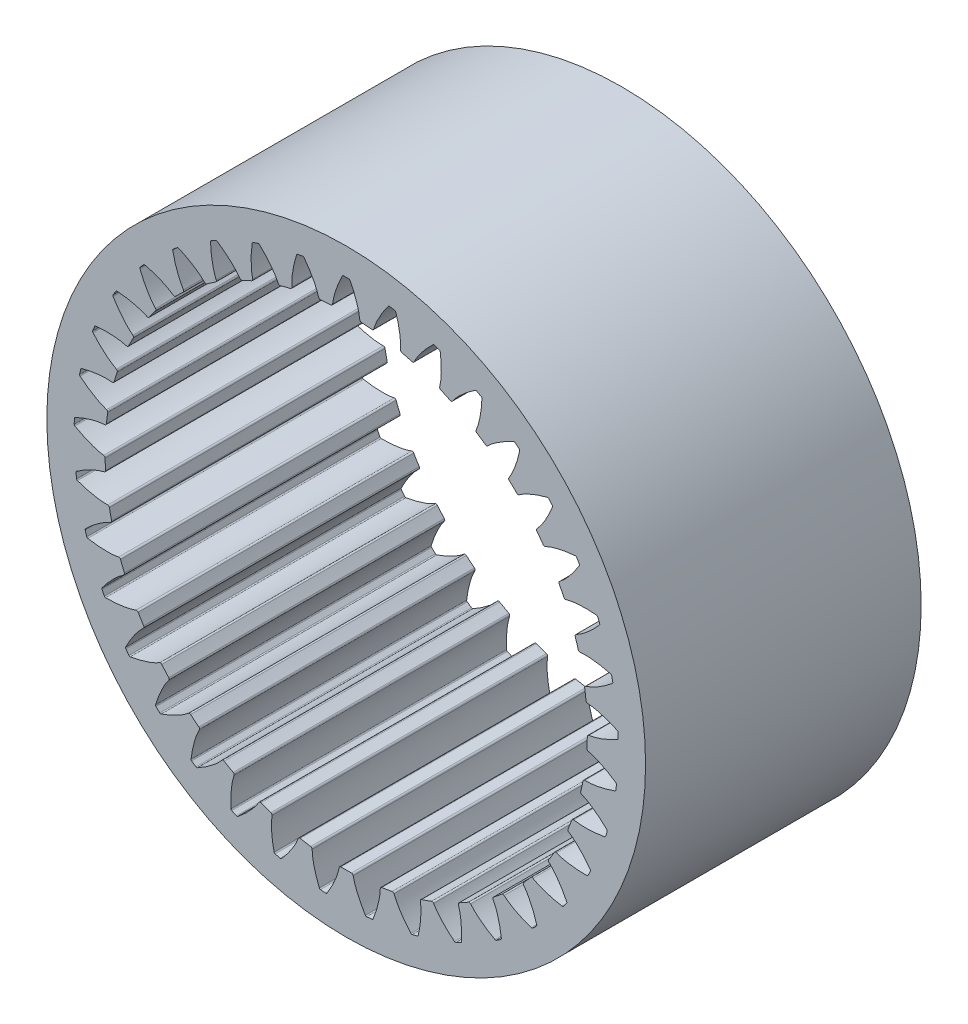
from build123d import *

# Parameters (mm, degrees)
SKETCH5_R              = 13.795375
SKETCH5_R_2            = 11.1125
RING_GEAR_BLANK_DEPTH  = 6.35
FIRST_TOOTH_DEPTH      = 21.516998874
TIP_RADIUS_R           = 0.079375
ROOT_FILLET_R          = 0.0635
TEETH_COUNT            = 37
TIP_RADIUS_OF_TEETH_R  = 0.079375
ROOT_FILLET_OF_TEETH_R = 0.0635


with BuildPart() as part:
    # Sketch5 → Ring Gear Blank (new, symmetric)
    with BuildSketch(Plane.XY):
        with Locations(Location((0, 0, 0), (0, 0, 180))):
            Circle(SKETCH5_R)
        with Locations(Location((0, 0, 0), (0, 0, 180))):
            Circle(SKETCH5_R_2, mode=Mode.SUBTRACT)
    extrude(amount=RING_GEAR_BLANK_DEPTH, both=True)

    # Sketch2 → First Tooth (cut, symmetric)
    with BuildSketch(Plane.XY):
        with BuildLine():
            ThreePointArc((0.159062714, 12.54024125), (0, 12.54125), (-0.159062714, 12.54024125))
            add(Edge.make_bspline(
                [(-0.159062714, 12.54024125), (-0.194460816, 12.472541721), (-0.24561014, 12.369969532), (-0.309503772, 12.23116819), (-0.355153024, 12.1260507), (-0.398397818, 12.019920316), (-0.439084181, 11.912781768), (-0.477032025, 11.804641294), (-0.512025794, 11.695506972), (-0.543802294, 11.585390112), (-0.572022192, 11.47430415), (-0.59625071, 11.362275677), (-0.615793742, 11.249316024), (-0.629794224, 11.135554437), (-0.63540838, 11.020813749), (-0.625574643, 10.906500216), (-0.619880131, 10.792072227), (-0.613076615, 10.677674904), (-0.60656989, 10.563269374), (-0.507430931, 8.840865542), (-0.415639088, 7.156453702), (-0.316416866, 5.510442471)],
                knots=[0, 0, 0, 0, 0.032171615, 0.048257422, 0.06434323, 0.080429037, 0.096514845, 0.112600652, 0.128686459, 0.144772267, 0.160858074, 0.176943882, 0.193029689, 0.209115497, 0.225201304, 0.241287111, 0.257372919, 0.273458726, 0.289544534, 0.305630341, 1, 1, 1, 1], degree=3))
            ThreePointArc((-0.316416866, 5.510442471), (0, -5.519519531), (0.316416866, 5.510442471))
            add(Edge.make_bspline(
                [(0.159062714, 12.54024125), (0.194460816, 12.472541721), (0.24561014, 12.369969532), (0.309503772, 12.23116819), (0.355153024, 12.1260507), (0.398397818, 12.019920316), (0.439084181, 11.912781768), (0.477032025, 11.804641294), (0.512025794, 11.695506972), (0.543802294, 11.585390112), (0.572022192, 11.47430415), (0.59625071, 11.362275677), (0.615793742, 11.249316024), (0.629794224, 11.135554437), (0.63540838, 11.020813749), (0.625574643, 10.906500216), (0.619880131, 10.792072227), (0.613076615, 10.677674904), (0.60656989, 10.563269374), (0.507430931, 8.840865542), (0.415639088, 7.156453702), (0.316416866, 5.510442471)],
                knots=[0, 0, 0, 0, 0.032171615, 0.048257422, 0.06434323, 0.080429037, 0.096514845, 0.112600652, 0.128686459, 0.144772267, 0.160858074, 0.176943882, 0.193029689, 0.209115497, 0.225201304, 0.241287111, 0.257372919, 0.273458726, 0.289544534, 0.305630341, 1, 1, 1, 1], degree=3))
        make_face()
    first_tooth = extrude(amount=FIRST_TOOTH_DEPTH, both=True, mode=Mode.SUBTRACT)

    # Tip Radius
    tip_radius_edges = [part.edges().sort_by_distance(p)[0] for p in [
        (-0.631309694, 11.094552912, 3.175),
        (0.631309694, 11.094552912, 3.175),
    ]]
    fillet(tip_radius_edges, radius=TIP_RADIUS_R)

    # Root Fillet
    root_fillet_edges = [part.edges().sort_by_distance(p)[0] for p in [
        (-0.159062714, 12.54024125, 3.175),
        (0.159062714, 12.54024125, -3.175),
    ]]
    fillet(root_fillet_edges, radius=ROOT_FILLET_R)

    # Teeth: First Tooth ×37 about axis
    teeth_axis = Axis((0, 0, 6.35), (0, 0, -1))
    for i in range(1, TEETH_COUNT):
        add(first_tooth.rotate(teeth_axis, i * 360 / TEETH_COUNT), mode=Mode.SUBTRACT)

    # Tip Radius of Teeth
    tip_radius_of_teeth_edges = [part.edges().sort_by_distance(p)[0] for p in [
        (1.252759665, 11.041659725, 3.175),
        (2.497217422, 10.828276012, 3.175),
        (3.100789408, 10.67111809, 3.175),
        (4.291284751, 10.250489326, 3.175),
        (4.859615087, 9.993587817, 3.175),
        (5.961899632, 9.377814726, 3.175),
        (6.478638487, 9.028560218, 3.175),
        (7.461001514, 8.23535747, 3.175),
        (7.911283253, 7.80379738, 3.175),
        (8.745463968, 6.855983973, 3.175),
        (9.116334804, 6.354533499, 3.175),
        (9.778335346, 5.2793763, 3.175),
        (10.059126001, 4.722461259, 3.175),
        (10.529901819, 3.550890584, 3.175),
        (10.712534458, 2.954532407, 3.175),
        (10.978542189, 1.72025221, 3.175),
        (11.057762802, 1.101607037, 3.175),
        (11.111349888, -0.159874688, 3.175),
        (11.084879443, -0.783009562, 3.175),
        (10.924504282, -2.035402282, 3.175),
        (10.793104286, -2.645100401, 3.175),
        (10.423380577, -3.852375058, 3.175),
        (10.190831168, -4.431096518, 3.175),
        (9.622395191, -5.558522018, 3.175),
        (9.295386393, -6.089618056, 3.175),
        (8.544591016, -7.10476042, 3.175),
        (8.132530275, -7.572952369, 3.175),
        (7.220974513, -8.4466078, 3.175),
        (6.735716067, -8.838426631, 3.175),
        (5.689623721, -9.545461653, 3.175),
        (5.145127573, -9.849635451, 3.175),
        (3.994592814, -10.369709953, 3.175),
        (3.406523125, -10.577488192, 3.175),
        (2.184644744, -10.895640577, 3.175),
        (1.56991921, -11.001045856, 3.175),
        (0.311848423, -11.10812346, 3.175),
        (-0.311848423, -11.10812346, 3.175),
        (-1.56991921, -11.001045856, 3.175),
        (-2.184644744, -10.895640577, 3.175),
        (-3.406523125, -10.577488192, 3.175),
        (-3.994592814, -10.369709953, 3.175),
        (-5.145127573, -9.849635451, 3.175),
        (-5.689623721, -9.545461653, 3.175),
        (-6.735716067, -8.838426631, 3.175),
        (-7.220974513, -8.4466078, 3.175),
        (-8.132530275, -7.572952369, 3.175),
        (-8.544591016, -7.10476042, 3.175),
        (-9.295386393, -6.089618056, 3.175),
        (-9.622395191, -5.558522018, 3.175),
        (-10.190831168, -4.431096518, 3.175),
        (-10.423380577, -3.852375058, 3.175),
        (-10.793104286, -2.645100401, 3.175),
        (-10.924504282, -2.035402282, 3.175),
        (-11.084879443, -0.783009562, 3.175),
        (-11.111349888, -0.159874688, 3.175),
        (-11.057762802, 1.101607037, 3.175),
        (-10.978542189, 1.72025221, 3.175),
        (-10.712534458, 2.954532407, 3.175),
        (-10.529901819, 3.550890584, 3.175),
        (-10.059126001, 4.722461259, 3.175),
        (-9.778335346, 5.2793763, 3.175),
        (-9.116334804, 6.354533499, 3.175),
        (-8.745463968, 6.855983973, 3.175),
        (-7.911283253, 7.80379738, 3.175),
        (-7.461001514, 8.23535747, 3.175),
        (-6.478638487, 9.028560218, 3.175),
        (-5.961899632, 9.377814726, 3.175),
        (-4.859615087, 9.993587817, 3.175),
        (-4.291284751, 10.250489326, 3.175),
        (-3.100789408, 10.67111809, 3.175),
        (-2.497217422, 10.828276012, 3.175),
        (-1.252759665, 11.041659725, 3.175),
    ]]
    fillet(tip_radius_of_teeth_edges, radius=TIP_RADIUS_OF_TEETH_R)

    # Root Fillet of Teeth
    root_fillet_of_teeth_edges = [part.edges().sort_by_distance(p)[0] for p in [
        (1.962536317, 12.386743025, 3.175),
        (2.2760858, 12.332979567, -3.175),
        (4.027676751, 11.876900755, 3.175),
        (4.327630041, 11.770920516, -3.175),
        (5.976948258, 11.025381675, 3.175),
        (6.254676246, 10.870233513, -3.175),
        (7.754273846, 9.856682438, 3.175),
        (8.001786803, 9.656829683, -3.175),
        (9.308523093, 8.404424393, 3.175),
        (9.518700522, 8.165616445, -3.175),
        (10.594983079, 6.710386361, 3.175),
        (10.761778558, 6.439493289, -3.175),
        (11.576644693, 4.82330273, 3.175),
        (11.695259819, 4.528117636, -3.175),
        (12.225267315, 2.797461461, 3.175),
        (12.292289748, 2.486476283, -3.175),
        (12.522191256, 0.69114232, 3.175),
        (12.535692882, 0.373303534, -3.175),
        (12.458874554, -1.435059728, 3.175),
        (12.418466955, -1.750608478, -3.175),
        (12.037138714, -3.51997772, 3.175),
        (11.943984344, -3.824158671, -3.175),
        (11.269116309, -5.503632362, 3.175),
        (11.12589505, -5.787694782, -3.175),
        (10.176901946, -7.328957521, 3.175),
        (9.987734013, -7.584729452, -3.175),
        (8.791916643, -8.943441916, 3.175),
        (8.562244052, -9.163565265, -3.175),
        (7.154003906, -10.300639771, 3.175),
        (6.890433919, -10.478781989, -3.175),
        (5.310283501, -11.361506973, 3.175),
        (5.020398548, -11.492543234, -3.175),
        (3.313795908, -12.095524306, 3.175),
        (3.005935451, -12.175684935, -3.175),
        (1.221976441, -12.481575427, 3.175),
        (0.904997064, -12.508554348, -3.175),
        (-0.904997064, -12.508554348, 3.175),
        (-1.221976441, -12.481575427, -3.175),
        (-3.005935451, -12.175684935, 3.175),
        (-3.313795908, -12.095524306, -3.175),
        (-5.020398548, -11.492543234, 3.175),
        (-5.310283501, -11.361506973, -3.175),
        (-6.890433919, -10.478781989, 3.175),
        (-7.154003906, -10.300639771, -3.175),
        (-8.562244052, -9.163565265, 3.175),
        (-8.791916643, -8.943441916, -3.175),
        (-9.987734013, -7.584729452, 3.175),
        (-10.176901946, -7.328957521, -3.175),
        (-11.12589505, -5.787694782, 3.175),
        (-11.269116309, -5.503632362, -3.175),
        (-11.943984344, -3.824158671, 3.175),
        (-12.037138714, -3.51997772, -3.175),
        (-12.418466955, -1.750608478, 3.175),
        (-12.458874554, -1.435059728, -3.175),
        (-12.535692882, 0.373303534, 3.175),
        (-12.522191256, 0.69114232, -3.175),
        (-12.292289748, 2.486476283, 3.175),
        (-12.225267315, 2.797461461, -3.175),
        (-11.695259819, 4.528117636, 3.175),
        (-11.576644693, 4.82330273, -3.175),
        (-10.761778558, 6.439493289, 3.175),
        (-10.594983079, 6.710386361, -3.175),
        (-9.518700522, 8.165616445, 3.175),
        (-9.308523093, 8.404424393, -3.175),
        (-8.001786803, 9.656829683, 3.175),
        (-7.754273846, 9.856682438, -3.175),
        (-6.254676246, 10.870233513, 3.175),
        (-5.976948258, 11.025381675, -3.175),
        (-4.327630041, 11.770920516, 3.175),
        (-4.027676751, 11.876900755, -3.175),
        (-2.2760858, 12.332979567, 3.175),
        (-1.962536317, 12.386743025, -3.175),
    ]]
    fillet(root_fillet_of_teeth_edges, radius=ROOT_FILLET_OF_TEETH_R)


solid = part.part
